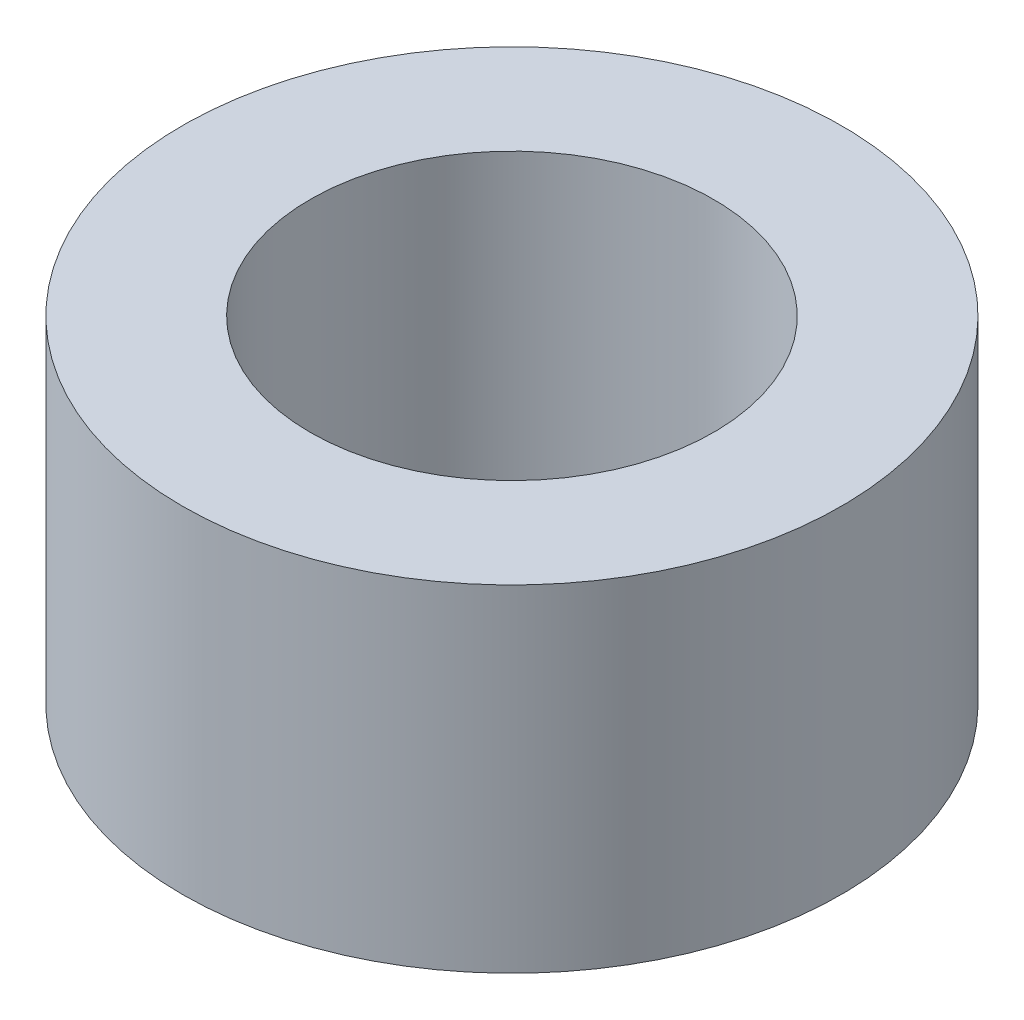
ISO-10303-21;
HEADER;
FILE_DESCRIPTION(('STEP AP214'),'2;1');
FILE_NAME('part.step','',(''),(''),'','','');
FILE_SCHEMA(('AUTOMOTIVE_DESIGN { 1 0 10303 214 1 1 1 1 }'));
ENDSEC;
DATA;
#1=APPLICATION_CONTEXT('core data for automotive mechanical design processes');
#2=APPLICATION_PROTOCOL_DEFINITION('international standard','automotive_design',2000,#1);
#3=PRODUCT_CONTEXT('',#1,'mechanical');
#4=PRODUCT('Part','Part','',(#3));
#5=PRODUCT_RELATED_PRODUCT_CATEGORY('part','',(#4));
#6=PRODUCT_DEFINITION_FORMATION('','',#4);
#7=PRODUCT_DEFINITION_CONTEXT('part definition',#1,'design');
#8=PRODUCT_DEFINITION('design','',#6,#7);
#9=PRODUCT_DEFINITION_SHAPE('','',#8);
#10=(LENGTH_UNIT() NAMED_UNIT(*) SI_UNIT(.MILLI.,.METRE.));
#11=(NAMED_UNIT(*) PLANE_ANGLE_UNIT() SI_UNIT($,.RADIAN.));
#12=(NAMED_UNIT(*) SI_UNIT($,.STERADIAN.) SOLID_ANGLE_UNIT());
#13=UNCERTAINTY_MEASURE_WITH_UNIT(LENGTH_MEASURE(1.E-05),#10,'distance_accuracy_value','');
#14=(GEOMETRIC_REPRESENTATION_CONTEXT(3) GLOBAL_UNCERTAINTY_ASSIGNED_CONTEXT((#13)) GLOBAL_UNIT_ASSIGNED_CONTEXT((#10,
#11,#12)) REPRESENTATION_CONTEXT('',''));
#15=CARTESIAN_POINT('',(0.,0.,0.));
#16=DIRECTION('',(0.,0.,1.));
#17=DIRECTION('',(1.,0.,0.));
#18=AXIS2_PLACEMENT_3D('',#15,#16,#17);
#19=CARTESIAN_POINT('',(0.,12.7,0.));
#20=DIRECTION('',(0.,1.,0.));
#21=DIRECTION('',(0.,0.,1.));
#22=AXIS2_PLACEMENT_3D('',#19,#20,#21);
#23=PLANE('',#22);
#24=CARTESIAN_POINT('',(0.,12.7,0.));
#25=DIRECTION('',(0.,1.,0.));
#26=DIRECTION('',(0.,0.,1.));
#27=AXIS2_PLACEMENT_3D('',#24,#25,#26);
#28=CIRCLE('',#27,12.446);
#29=CARTESIAN_POINT('',(0.,12.7,12.446));
#30=VERTEX_POINT('',#29);
#31=EDGE_CURVE('E10',#30,#30,#28,.T.);
#32=ORIENTED_EDGE('',*,*,#31,.T.);
#33=EDGE_LOOP('',(#32));
#34=FACE_BOUND('',#33,.T.);
#35=CARTESIAN_POINT('',(0.,12.7,0.));
#36=DIRECTION('',(0.,1.,0.));
#37=DIRECTION('',(0.,0.,1.));
#38=AXIS2_PLACEMENT_3D('',#35,#36,#37);
#39=CIRCLE('',#38,7.62);
#40=CARTESIAN_POINT('',(0.,12.7,7.62));
#41=VERTEX_POINT('',#40);
#42=EDGE_CURVE('E43',#41,#41,#39,.T.);
#43=ORIENTED_EDGE('',*,*,#42,.F.);
#44=EDGE_LOOP('',(#43));
#45=FACE_BOUND('',#44,.T.);
#46=ADVANCED_FACE('F32',(#34,#45),#23,.T.);
#47=CARTESIAN_POINT('',(0.,0.,0.));
#48=DIRECTION('',(0.,1.,0.));
#49=DIRECTION('',(0.,0.,1.));
#50=AXIS2_PLACEMENT_3D('',#47,#48,#49);
#51=PLANE('',#50);
#52=CARTESIAN_POINT('',(0.,0.,0.));
#53=DIRECTION('',(0.,1.,0.));
#54=DIRECTION('',(0.,0.,1.));
#55=AXIS2_PLACEMENT_3D('',#52,#53,#54);
#56=CIRCLE('',#55,12.446);
#57=CARTESIAN_POINT('',(0.,0.,12.446));
#58=VERTEX_POINT('',#57);
#59=EDGE_CURVE('E36',#58,#58,#56,.T.);
#60=ORIENTED_EDGE('',*,*,#59,.F.);
#61=EDGE_LOOP('',(#60));
#62=FACE_BOUND('',#61,.T.);
#63=CARTESIAN_POINT('',(0.,0.,0.));
#64=DIRECTION('',(0.,1.,0.));
#65=DIRECTION('',(0.,0.,1.));
#66=AXIS2_PLACEMENT_3D('',#63,#64,#65);
#67=CIRCLE('',#66,7.62);
#68=CARTESIAN_POINT('',(0.,0.,7.62));
#69=VERTEX_POINT('',#68);
#70=EDGE_CURVE('E45',#69,#69,#67,.T.);
#71=ORIENTED_EDGE('',*,*,#70,.T.);
#72=EDGE_LOOP('',(#71));
#73=FACE_BOUND('',#72,.T.);
#74=ADVANCED_FACE('F55',(#62,#73),#51,.F.);
#75=CARTESIAN_POINT('',(0.,12.7,0.));
#76=DIRECTION('',(0.,-1.,0.));
#77=DIRECTION('',(0.,0.,-1.));
#78=AXIS2_PLACEMENT_3D('',#75,#76,#77);
#79=CYLINDRICAL_SURFACE('',#78,12.446);
#80=ORIENTED_EDGE('',*,*,#31,.F.);
#81=EDGE_LOOP('',(#80));
#82=FACE_BOUND('',#81,.T.);
#83=ORIENTED_EDGE('',*,*,#59,.T.);
#84=EDGE_LOOP('',(#83));
#85=FACE_BOUND('',#84,.T.);
#86=ADVANCED_FACE('F34',(#82,#85),#79,.T.);
#87=CARTESIAN_POINT('',(0.,12.7,0.));
#88=DIRECTION('',(0.,-1.,0.));
#89=DIRECTION('',(0.,0.,-1.));
#90=AXIS2_PLACEMENT_3D('',#87,#88,#89);
#91=CYLINDRICAL_SURFACE('',#90,7.62);
#92=ORIENTED_EDGE('',*,*,#42,.T.);
#93=EDGE_LOOP('',(#92));
#94=FACE_BOUND('',#93,.T.);
#95=ORIENTED_EDGE('',*,*,#70,.F.);
#96=EDGE_LOOP('',(#95));
#97=FACE_BOUND('',#96,.T.);
#98=ADVANCED_FACE('F51',(#94,#97),#91,.F.);
#99=CLOSED_SHELL('',(#46,#74,#86,#98));
#100=MANIFOLD_SOLID_BREP('B2',#99);
#101=ADVANCED_BREP_SHAPE_REPRESENTATION('',(#18,#100),#14);
#102=SHAPE_DEFINITION_REPRESENTATION(#9,#101);
ENDSEC;
END-ISO-10303-21;
